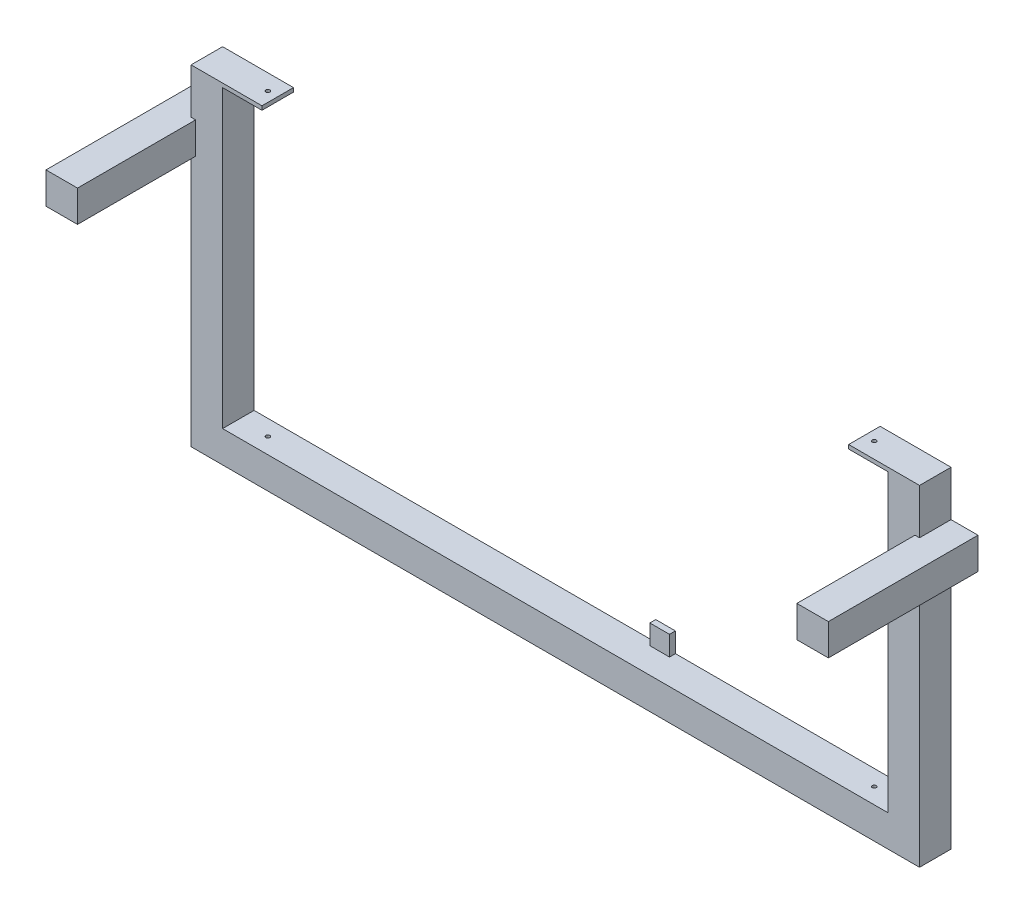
from build123d import *

# Parameters (mm, degrees)
ESQUISSE1_W             = 1850
ESQUISSE1_H             = 80
BASE_EXTRUSION_DEPTH    = 40
ESQUISSE2_W             = 80
ESQUISSE2_H             = 80
BOSS_EXTRU_1_DEPTH      = 750
ESQUISSE3_W             = 180
ESQUISSE3_H             = 80
BOSS_EXTRU_2_DEPTH      = 10
ESQUISSE4_R             = 5
ENL_V_MAT_EXTRU_1_DEPTH = 1251.129993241
ESQUISSE5_W             = 80
ESQUISSE5_H             = 80
BOSS_EXTRU_3_DEPTH      = 380
ESQUISSE6_W             = 50
ESQUISSE6_H             = 15
BOSS_EXTRU_4_DEPTH      = 50


with BuildPart() as part:
    # Esquisse1 → Base-Extrusion (new, symmetric)
    with BuildSketch(Plane.XY):
        Rectangle(ESQUISSE1_W, ESQUISSE1_H)
    extrude(amount=BASE_EXTRUSION_DEPTH, both=True)

    # Esquisse2 → Boss.-Extru.1 (add)
    with BuildSketch(Plane(origin=(0, 40, 0), x_dir=(-1, 0, 0), z_dir=(0, 1, 0))):
        with Locations((885, 0)):
            Rectangle(ESQUISSE2_W, ESQUISSE2_H)
        with Locations((-885, 0)):
            Rectangle(ESQUISSE2_W, ESQUISSE2_H)
    extrude(amount=BOSS_EXTRU_1_DEPTH)

    # Esquisse3 → Boss.-Extru.2 (add)
    with BuildSketch(Plane(origin=(0, 790, 0), x_dir=(-1, 0, 0), z_dir=(0, 1, 0))):
        with Locations((-835, 0)):
            Rectangle(ESQUISSE3_W, ESQUISSE3_H)
        with Locations((835, 0)):
            Rectangle(ESQUISSE3_W, ESQUISSE3_H)
    extrude(amount=BOSS_EXTRU_2_DEPTH)

    # Esquisse4 → Enl_v. mat.-Extru.1 (cut, through all)
    with BuildSketch(Plane(origin=(0, 800, 0), x_dir=(-1, 0, 0), z_dir=(0, 1, 0))):
        with Locations(Location((-770, 0, 0), (0, 0, 90))):
            Circle(ESQUISSE4_R)
        with Locations(Location((770, 0, 0), (0, 0, 90))):
            Circle(ESQUISSE4_R)
    extrude(amount=-ENL_V_MAT_EXTRU_1_DEPTH, mode=Mode.SUBTRACT)

    # Esquisse5 → Boss.-Extru.3 (add)
    with BuildSketch(Plane(origin=(0, 0, -40), x_dir=(-1, 0, 0), z_dir=(0, 0, -1))):
        with Locations((953.5, 644.76)):
            Rectangle(ESQUISSE5_W, ESQUISSE5_H)
        with Locations((-953.5, 644.76)):
            Rectangle(ESQUISSE5_W, ESQUISSE5_H)
    extrude(amount=-BOSS_EXTRU_3_DEPTH)

    # Esquisse6 → Boss.-Extru.4 (add)
    with BuildSketch(Plane(origin=(0, 40, 0), x_dir=(-1, 0, 0), z_dir=(0, 1, 0))):
        with Locations((-200, -32.5)):
            Rectangle(ESQUISSE6_W, ESQUISSE6_H)
    extrude(amount=BOSS_EXTRU_4_DEPTH)


solid = part.part
